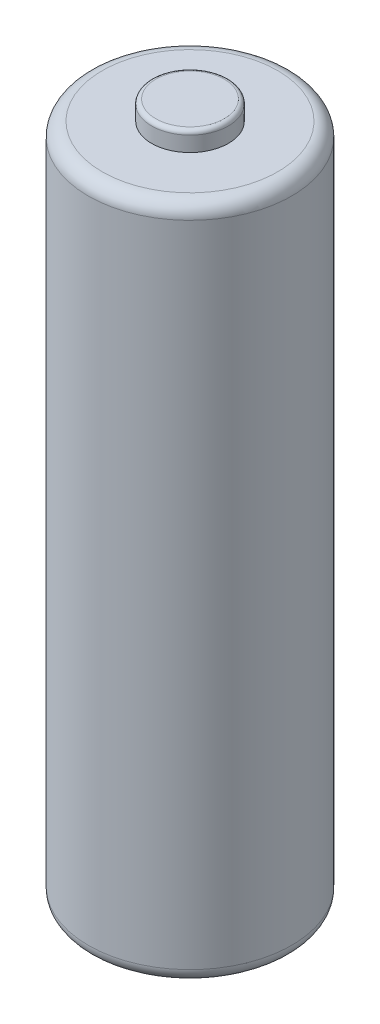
ISO-10303-21;
HEADER;
FILE_DESCRIPTION(('STEP AP214'),'2;1');
FILE_NAME('part.step','',(''),(''),'','','');
FILE_SCHEMA(('AUTOMOTIVE_DESIGN { 1 0 10303 214 1 1 1 1 }'));
ENDSEC;
DATA;
#1=APPLICATION_CONTEXT('core data for automotive mechanical design processes');
#2=APPLICATION_PROTOCOL_DEFINITION('international standard','automotive_design',2000,#1);
#3=PRODUCT_CONTEXT('',#1,'mechanical');
#4=PRODUCT('Part','Part','',(#3));
#5=PRODUCT_RELATED_PRODUCT_CATEGORY('part','',(#4));
#6=PRODUCT_DEFINITION_FORMATION('','',#4);
#7=PRODUCT_DEFINITION_CONTEXT('part definition',#1,'design');
#8=PRODUCT_DEFINITION('design','',#6,#7);
#9=PRODUCT_DEFINITION_SHAPE('','',#8);
#10=(LENGTH_UNIT() NAMED_UNIT(*) SI_UNIT(.MILLI.,.METRE.));
#11=(NAMED_UNIT(*) PLANE_ANGLE_UNIT() SI_UNIT($,.RADIAN.));
#12=(NAMED_UNIT(*) SI_UNIT($,.STERADIAN.) SOLID_ANGLE_UNIT());
#13=UNCERTAINTY_MEASURE_WITH_UNIT(LENGTH_MEASURE(1.E-05),#10,'distance_accuracy_value','');
#14=(GEOMETRIC_REPRESENTATION_CONTEXT(3) GLOBAL_UNCERTAINTY_ASSIGNED_CONTEXT((#13)) GLOBAL_UNIT_ASSIGNED_CONTEXT((#10,
#11,#12)) REPRESENTATION_CONTEXT('',''));
#15=CARTESIAN_POINT('',(0.,0.,0.));
#16=DIRECTION('',(0.,0.,1.));
#17=DIRECTION('',(1.,0.,0.));
#18=AXIS2_PLACEMENT_3D('',#15,#16,#17);
#19=CARTESIAN_POINT('',(0.,49.8,0.));
#20=DIRECTION('',(0.,1.,0.));
#21=DIRECTION('',(0.,0.,1.));
#22=AXIS2_PLACEMENT_3D('',#19,#20,#21);
#23=PLANE('',#22);
#24=CARTESIAN_POINT('',(0.,49.8,0.));
#25=DIRECTION('',(0.,-1.,0.));
#26=DIRECTION('',(0.,0.,-1.));
#27=AXIS2_PLACEMENT_3D('',#24,#25,#26);
#28=CIRCLE('',#27,2.45);
#29=CARTESIAN_POINT('',(0.,49.8,-2.45));
#30=VERTEX_POINT('',#29);
#31=CARTESIAN_POINT('',(0.,49.8,2.45));
#32=VERTEX_POINT('',#31);
#33=EDGE_CURVE('E62',#30,#32,#28,.T.);
#34=ORIENTED_EDGE('',*,*,#33,.F.);
#35=CARTESIAN_POINT('',(0.,49.8,0.));
#36=DIRECTION('',(0.,-1.,0.));
#37=DIRECTION('',(0.,0.,1.));
#38=AXIS2_PLACEMENT_3D('',#35,#36,#37);
#39=CIRCLE('',#38,2.45);
#40=EDGE_CURVE('E58',#32,#30,#39,.T.);
#41=ORIENTED_EDGE('',*,*,#40,.F.);
#42=EDGE_LOOP('',(#34,#41));
#43=FACE_BOUND('',#42,.T.);
#44=ADVANCED_FACE('F17',(#43),#23,.T.);
#45=CARTESIAN_POINT('',(0.,-0.5,0.));
#46=DIRECTION('',(0.,-1.,0.));
#47=DIRECTION('',(0.,0.,-1.));
#48=AXIS2_PLACEMENT_3D('',#45,#46,#47);
#49=PLANE('',#48);
#50=CARTESIAN_POINT('',(0.,-0.5,0.));
#51=DIRECTION('',(0.,1.,0.));
#52=DIRECTION('',(0.,0.,1.));
#53=AXIS2_PLACEMENT_3D('',#50,#51,#52);
#54=CIRCLE('',#53,3.5);
#55=CARTESIAN_POINT('',(0.,-0.5,3.5));
#56=VERTEX_POINT('',#55);
#57=CARTESIAN_POINT('',(0.,-0.5,-3.5));
#58=VERTEX_POINT('',#57);
#59=EDGE_CURVE('E69',#56,#58,#54,.T.);
#60=ORIENTED_EDGE('',*,*,#59,.F.);
#61=CARTESIAN_POINT('',(0.,-0.5,0.));
#62=DIRECTION('',(0.,1.,0.));
#63=DIRECTION('',(0.,0.,-1.));
#64=AXIS2_PLACEMENT_3D('',#61,#62,#63);
#65=CIRCLE('',#64,3.5);
#66=EDGE_CURVE('E111',#58,#56,#65,.T.);
#67=ORIENTED_EDGE('',*,*,#66,.F.);
#68=EDGE_LOOP('',(#60,#67));
#69=FACE_BOUND('',#68,.T.);
#70=ADVANCED_FACE('F88',(#69),#49,.T.);
#71=CARTESIAN_POINT('',(0.,49.5,0.));
#72=DIRECTION('',(0.,1.,0.));
#73=DIRECTION('',(0.,0.,1.));
#74=AXIS2_PLACEMENT_3D('',#71,#72,#73);
#75=TOROIDAL_SURFACE('',#74,2.45,0.3);
#76=ORIENTED_EDGE('',*,*,#40,.T.);
#77=ORIENTED_EDGE('',*,*,#33,.T.);
#78=EDGE_LOOP('',(#76,#77));
#79=FACE_BOUND('',#78,.T.);
#80=CARTESIAN_POINT('',(0.,49.5,0.));
#81=DIRECTION('',(0.,-1.,0.));
#82=DIRECTION('',(0.,0.,-1.));
#83=AXIS2_PLACEMENT_3D('',#80,#81,#82);
#84=CIRCLE('',#83,2.75);
#85=CARTESIAN_POINT('',(0.,49.5,-2.75));
#86=VERTEX_POINT('',#85);
#87=EDGE_CURVE('E97',#86,#86,#84,.T.);
#88=ORIENTED_EDGE('',*,*,#87,.F.);
#89=EDGE_LOOP('',(#88));
#90=FACE_BOUND('',#89,.T.);
#91=ADVANCED_FACE('F67',(#79,#90),#75,.T.);
#92=CARTESIAN_POINT('',(0.,-0.2,0.));
#93=DIRECTION('',(0.,-1.,0.));
#94=DIRECTION('',(0.,0.,-1.));
#95=AXIS2_PLACEMENT_3D('',#92,#93,#94);
#96=TOROIDAL_SURFACE('',#95,3.5,0.3);
#97=CARTESIAN_POINT('',(0.,-0.2,0.));
#98=DIRECTION('',(0.,1.,0.));
#99=DIRECTION('',(0.,0.,1.));
#100=AXIS2_PLACEMENT_3D('',#97,#98,#99);
#101=CIRCLE('',#100,3.8);
#102=CARTESIAN_POINT('',(0.,-0.2,3.8));
#103=VERTEX_POINT('',#102);
#104=EDGE_CURVE('E138',#103,#103,#101,.T.);
#105=ORIENTED_EDGE('',*,*,#104,.F.);
#106=EDGE_LOOP('',(#105));
#107=FACE_BOUND('',#106,.T.);
#108=ORIENTED_EDGE('',*,*,#66,.T.);
#109=ORIENTED_EDGE('',*,*,#59,.T.);
#110=EDGE_LOOP('',(#108,#109));
#111=FACE_BOUND('',#110,.T.);
#112=ADVANCED_FACE('F87',(#107,#111),#96,.T.);
#113=CARTESIAN_POINT('',(0.,49.8,0.));
#114=DIRECTION('',(0.,-1.,0.));
#115=DIRECTION('',(0.,0.,-1.));
#116=AXIS2_PLACEMENT_3D('',#113,#114,#115);
#117=CYLINDRICAL_SURFACE('',#116,2.75);
#118=CARTESIAN_POINT('',(0.,48.42,0.));
#119=DIRECTION('',(0.,-1.,0.));
#120=DIRECTION('',(0.,0.,-1.));
#121=AXIS2_PLACEMENT_3D('',#118,#119,#120);
#122=CIRCLE('',#121,2.75);
#123=CARTESIAN_POINT('',(0.,48.42,-2.75));
#124=VERTEX_POINT('',#123);
#125=EDGE_CURVE('E142',#124,#124,#122,.T.);
#126=ORIENTED_EDGE('',*,*,#125,.F.);
#127=EDGE_LOOP('',(#126));
#128=FACE_BOUND('',#127,.T.);
#129=ORIENTED_EDGE('',*,*,#87,.T.);
#130=EDGE_LOOP('',(#129));
#131=FACE_BOUND('',#130,.T.);
#132=ADVANCED_FACE('F235',(#128,#131),#117,.T.);
#133=CARTESIAN_POINT('',(0.,-0.5,0.));
#134=DIRECTION('',(0.,1.,0.));
#135=DIRECTION('',(0.,0.,1.));
#136=AXIS2_PLACEMENT_3D('',#133,#134,#135);
#137=CYLINDRICAL_SURFACE('',#136,3.8);
#138=ORIENTED_EDGE('',*,*,#104,.T.);
#139=EDGE_LOOP('',(#138));
#140=FACE_BOUND('',#139,.T.);
#141=CARTESIAN_POINT('',(0.,0.,0.));
#142=DIRECTION('',(0.,1.,0.));
#143=DIRECTION('',(0.,0.,1.));
#144=AXIS2_PLACEMENT_3D('',#141,#142,#143);
#145=CIRCLE('',#144,3.8);
#146=CARTESIAN_POINT('',(0.,0.,3.8));
#147=VERTEX_POINT('',#146);
#148=EDGE_CURVE('E76',#147,#147,#145,.F.);
#149=ORIENTED_EDGE('',*,*,#148,.T.);
#150=EDGE_LOOP('',(#149));
#151=FACE_BOUND('',#150,.T.);
#152=ADVANCED_FACE('F224',(#140,#151),#137,.T.);
#153=CARTESIAN_POINT('',(0.,48.42,0.));
#154=DIRECTION('',(0.,1.,0.));
#155=DIRECTION('',(0.,0.,1.));
#156=AXIS2_PLACEMENT_3D('',#153,#154,#155);
#157=PLANE('',#156);
#158=ORIENTED_EDGE('',*,*,#125,.T.);
#159=EDGE_LOOP('',(#158));
#160=FACE_BOUND('',#159,.T.);
#161=CARTESIAN_POINT('',(0.,48.42,0.));
#162=DIRECTION('',(0.,-1.,0.));
#163=DIRECTION('',(0.,0.,-1.));
#164=AXIS2_PLACEMENT_3D('',#161,#162,#163);
#165=CIRCLE('',#164,6.275);
#166=CARTESIAN_POINT('',(0.,48.42,-6.275));
#167=VERTEX_POINT('',#166);
#168=CARTESIAN_POINT('',(0.,48.42,6.275));
#169=VERTEX_POINT('',#168);
#170=EDGE_CURVE('E211',#167,#169,#165,.T.);
#171=ORIENTED_EDGE('',*,*,#170,.F.);
#172=CARTESIAN_POINT('',(0.,48.42,0.));
#173=DIRECTION('',(0.,-1.,0.));
#174=DIRECTION('',(0.,0.,1.));
#175=AXIS2_PLACEMENT_3D('',#172,#173,#174);
#176=CIRCLE('',#175,6.275);
#177=EDGE_CURVE('E305',#169,#167,#176,.T.);
#178=ORIENTED_EDGE('',*,*,#177,.F.);
#179=EDGE_LOOP('',(#171,#178));
#180=FACE_BOUND('',#179,.T.);
#181=ADVANCED_FACE('F215',(#160,#180),#157,.T.);
#182=CARTESIAN_POINT('',(0.,0.,0.));
#183=DIRECTION('',(0.,1.,0.));
#184=DIRECTION('',(0.,0.,1.));
#185=AXIS2_PLACEMENT_3D('',#182,#183,#184);
#186=PLANE('',#185);
#187=ORIENTED_EDGE('',*,*,#148,.F.);
#188=EDGE_LOOP('',(#187));
#189=FACE_BOUND('',#188,.T.);
#190=CARTESIAN_POINT('',(0.,0.,0.));
#191=DIRECTION('',(0.,1.,0.));
#192=DIRECTION('',(0.,0.,1.));
#193=AXIS2_PLACEMENT_3D('',#190,#191,#192);
#194=CIRCLE('',#193,6.275);
#195=CARTESIAN_POINT('',(0.,0.,6.275));
#196=VERTEX_POINT('',#195);
#197=CARTESIAN_POINT('',(0.,0.,-6.275));
#198=VERTEX_POINT('',#197);
#199=EDGE_CURVE('E151',#196,#198,#194,.T.);
#200=ORIENTED_EDGE('',*,*,#199,.F.);
#201=CARTESIAN_POINT('',(0.,0.,0.));
#202=DIRECTION('',(0.,1.,0.));
#203=DIRECTION('',(0.,0.,-1.));
#204=AXIS2_PLACEMENT_3D('',#201,#202,#203);
#205=CIRCLE('',#204,6.275);
#206=EDGE_CURVE('E37',#198,#196,#205,.T.);
#207=ORIENTED_EDGE('',*,*,#206,.F.);
#208=EDGE_LOOP('',(#200,#207));
#209=FACE_BOUND('',#208,.T.);
#210=ADVANCED_FACE('F170',(#189,#209),#186,.F.);
#211=CARTESIAN_POINT('',(0.,47.42,0.));
#212=DIRECTION('',(0.,1.,0.));
#213=DIRECTION('',(0.,0.,1.));
#214=AXIS2_PLACEMENT_3D('',#211,#212,#213);
#215=TOROIDAL_SURFACE('',#214,6.275,1.);
#216=ORIENTED_EDGE('',*,*,#177,.T.);
#217=ORIENTED_EDGE('',*,*,#170,.T.);
#218=EDGE_LOOP('',(#216,#217));
#219=FACE_BOUND('',#218,.T.);
#220=CARTESIAN_POINT('',(0.,47.42,0.));
#221=DIRECTION('',(0.,-1.,0.));
#222=DIRECTION('',(0.,0.,-1.));
#223=AXIS2_PLACEMENT_3D('',#220,#221,#222);
#224=CIRCLE('',#223,7.275);
#225=CARTESIAN_POINT('',(0.,47.42,-7.275));
#226=VERTEX_POINT('',#225);
#227=EDGE_CURVE('E29',#226,#226,#224,.T.);
#228=ORIENTED_EDGE('',*,*,#227,.F.);
#229=EDGE_LOOP('',(#228));
#230=FACE_BOUND('',#229,.T.);
#231=ADVANCED_FACE('F158',(#219,#230),#215,.T.);
#232=CARTESIAN_POINT('',(0.,1.,0.));
#233=DIRECTION('',(0.,1.,0.));
#234=DIRECTION('',(0.,0.,1.));
#235=AXIS2_PLACEMENT_3D('',#232,#233,#234);
#236=TOROIDAL_SURFACE('',#235,6.275,1.);
#237=CARTESIAN_POINT('',(0.,1.,0.));
#238=DIRECTION('',(0.,-1.,0.));
#239=DIRECTION('',(0.,0.,-1.));
#240=AXIS2_PLACEMENT_3D('',#237,#238,#239);
#241=CIRCLE('',#240,7.275);
#242=CARTESIAN_POINT('',(0.,1.,-7.275));
#243=VERTEX_POINT('',#242);
#244=EDGE_CURVE('E11',#243,#243,#241,.F.);
#245=ORIENTED_EDGE('',*,*,#244,.F.);
#246=EDGE_LOOP('',(#245));
#247=FACE_BOUND('',#246,.T.);
#248=ORIENTED_EDGE('',*,*,#199,.T.);
#249=ORIENTED_EDGE('',*,*,#206,.T.);
#250=EDGE_LOOP('',(#248,#249));
#251=FACE_BOUND('',#250,.T.);
#252=ADVANCED_FACE('F169',(#247,#251),#236,.T.);
#253=CARTESIAN_POINT('',(0.,48.42,0.));
#254=DIRECTION('',(0.,-1.,0.));
#255=DIRECTION('',(0.,0.,-1.));
#256=AXIS2_PLACEMENT_3D('',#253,#254,#255);
#257=CYLINDRICAL_SURFACE('',#256,7.275);
#258=ORIENTED_EDGE('',*,*,#244,.T.);
#259=EDGE_LOOP('',(#258));
#260=FACE_BOUND('',#259,.T.);
#261=ORIENTED_EDGE('',*,*,#227,.T.);
#262=EDGE_LOOP('',(#261));
#263=FACE_BOUND('',#262,.T.);
#264=ADVANCED_FACE('F244',(#260,#263),#257,.T.);
#265=CLOSED_SHELL('',(#44,#70,#91,#112,#132,#152,#181,#210,#231,#252,#264));
#266=MANIFOLD_SOLID_BREP('B1',#265);
#267=ADVANCED_BREP_SHAPE_REPRESENTATION('',(#18,#266),#14);
#268=SHAPE_DEFINITION_REPRESENTATION(#9,#267);
ENDSEC;
END-ISO-10303-21;
